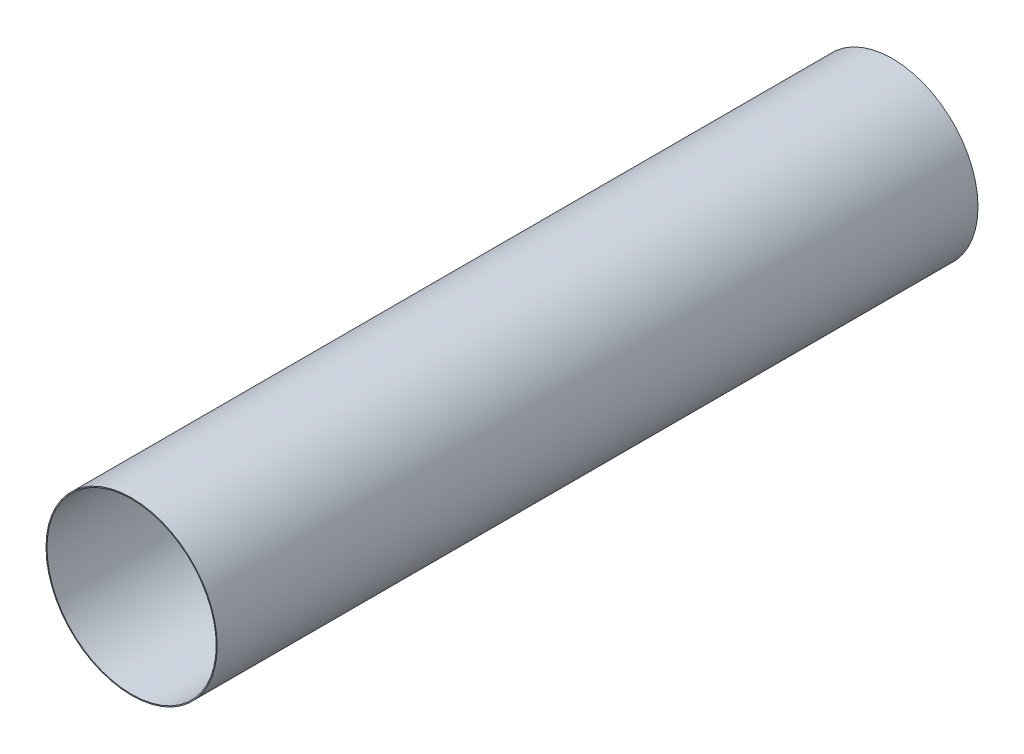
from build123d import *

# Parameters (mm, degrees)
ESQUISSE1_R        = 90
ESQUISSE1_R_2      = 89
BOSS_EXTRU_1_DEPTH = 800


with BuildPart() as part:
    # Esquisse1 → Boss.-Extru.1 (new body)
    with BuildSketch(Plane.XY):
        Circle(ESQUISSE1_R)
        Circle(ESQUISSE1_R_2, mode=Mode.SUBTRACT)
    extrude(amount=BOSS_EXTRU_1_DEPTH)


solid = part.part
